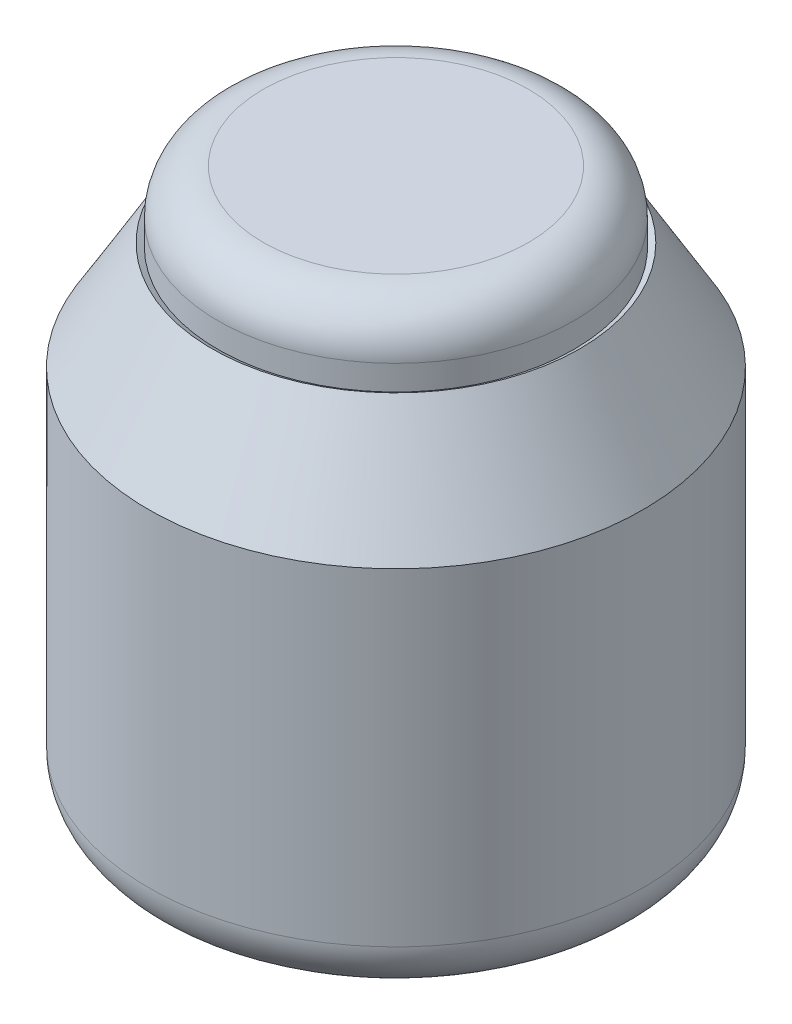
from build123d import *

# Parameters (mm, degrees)
LINEAR_AUSTRAGEN2_DEPTH = 2.5


with BuildPart() as part:
    # Skizze1 → Rotation1 (revolve)
    with BuildSketch(Plane.XY, mode=Mode.PRIVATE) as rotation1_sk:
        with BuildLine():
            Line((0, -72.299061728), (58.645925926, -72.299061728))
            ThreePointArc((58.645925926, -72.299061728), (72.78806155, -66.441197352), (78.645925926, -52.299061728))
            Line((78.645925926, -52.299061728), (78.645925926, 153.296987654))
            ThreePointArc((78.645925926, 153.296987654), (72.78806155, 167.439123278), (58.645925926, 173.296987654))
            Line((58.645925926, 173.296987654), (0, 173.296987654))
            Line((0, 173.296987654), (0, 171.296987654))
            Line((0, 171.296987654), (58.645925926, 171.296987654))
            ThreePointArc((58.645925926, 171.296987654), (71.373847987, 166.024909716), (76.645925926, 153.296987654))
            Line((76.645925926, 153.296987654), (76.645925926, -52.299061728))
            ThreePointArc((76.645925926, -52.299061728), (71.373847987, -65.02698379), (58.645925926, -70.299061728))
            Line((58.645925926, -70.299061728), (0, -70.299061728))
            Line((0, -70.299061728), (0, -72.299061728))
        make_face()
    revolve(rotation1_sk.sketch.rotate(Axis((0, -109.828345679, 0), (0, 1, 0)), 90), axis=Axis((0, -109.828345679, 0), (0, 1, 0)))


with BuildPart() as body_2:
    # Skizze1_6 → Rotation-D_nn3 (revolve)
    with BuildSketch(Plane.XY, mode=Mode.PRIVATE) as rotation_d_nn3_sk:
        with BuildLine():
            Line((70.453370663, -68.441683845), (86.240987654, -68.441683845))
            ThreePointArc((86.240987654, -68.441683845), (100.383123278, -62.583819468), (106.240987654, -48.441683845))
            Line((106.240987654, -48.441683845), (106.240987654, 95.47891358))
            Line((106.240987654, 95.47891358), (78.645925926, 142.326343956))
            Line((78.645925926, 142.326343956), (81.230817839, 143.848951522))
            Line((81.230817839, 143.848951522), (109.240987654, 96.296802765))
            Line((109.240987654, 96.296802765), (109.240987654, -48.441683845))
            ThreePointArc((109.240987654, -48.441683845), (102.504443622, -64.705139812), (86.240987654, -71.441683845))
            Line((86.240987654, -71.441683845), (70.453370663, -71.441683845))
            Line((70.453370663, -71.441683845), (70.453370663, -68.441683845))
        make_face()
    revolve(rotation_d_nn3_sk.sketch.rotate(Axis((0, -109.828345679, 0), (0, 1, 0)), 90), axis=Axis((0, -109.828345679, 0), (0, 1, 0)))

    # Skizze1_7 → Linear austragen2 (add, symmetric)
    with BuildSketch(Plane.XY):
        with BuildLine():
            ThreePointArc((78.645925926, -52.299061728), (76.480567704, -61.350335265), (70.453370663, -68.441683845))
            Line((70.453370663, -68.441683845), (86.240987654, -68.441683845))
            ThreePointArc((86.240987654, -68.441683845), (100.383123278, -62.583819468), (106.240987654, -48.441683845))
            Line((106.240987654, -48.441683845), (106.240987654, 95.47891358))
            Line((106.240987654, 95.47891358), (78.645925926, 142.326343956))
            Line((78.645925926, 142.326343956), (78.645925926, -52.299061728))
        make_face()
    extrude(amount=LINEAR_AUSTRAGEN2_DEPTH, both=True)


solid = Compound([part.part, body_2.part])
